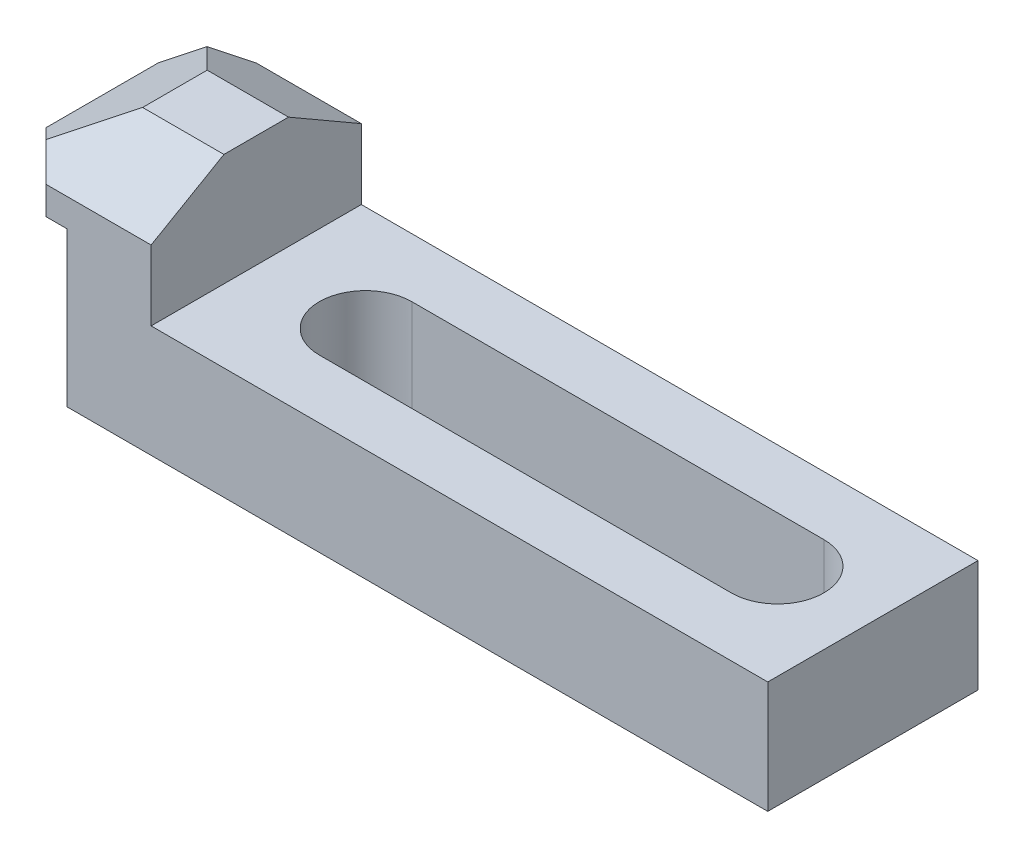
ISO-10303-21;
HEADER;
FILE_DESCRIPTION(('STEP AP214'),'2;1');
FILE_NAME('part.step','',(''),(''),'','','');
FILE_SCHEMA(('AUTOMOTIVE_DESIGN { 1 0 10303 214 1 1 1 1 }'));
ENDSEC;
DATA;
#1=APPLICATION_CONTEXT('core data for automotive mechanical design processes');
#2=APPLICATION_PROTOCOL_DEFINITION('international standard','automotive_design',2000,#1);
#3=PRODUCT_CONTEXT('',#1,'mechanical');
#4=PRODUCT('Part','Part','',(#3));
#5=PRODUCT_RELATED_PRODUCT_CATEGORY('part','',(#4));
#6=PRODUCT_DEFINITION_FORMATION('','',#4);
#7=PRODUCT_DEFINITION_CONTEXT('part definition',#1,'design');
#8=PRODUCT_DEFINITION('design','',#6,#7);
#9=PRODUCT_DEFINITION_SHAPE('','',#8);
#10=(LENGTH_UNIT() NAMED_UNIT(*) SI_UNIT(.MILLI.,.METRE.));
#11=(NAMED_UNIT(*) PLANE_ANGLE_UNIT() SI_UNIT($,.RADIAN.));
#12=(NAMED_UNIT(*) SI_UNIT($,.STERADIAN.) SOLID_ANGLE_UNIT());
#13=UNCERTAINTY_MEASURE_WITH_UNIT(LENGTH_MEASURE(1.E-05),#10,'distance_accuracy_value','');
#14=(GEOMETRIC_REPRESENTATION_CONTEXT(3) GLOBAL_UNCERTAINTY_ASSIGNED_CONTEXT((#13)) GLOBAL_UNIT_ASSIGNED_CONTEXT((#10,
#11,#12)) REPRESENTATION_CONTEXT('',''));
#15=CARTESIAN_POINT('',(0.,0.,0.));
#16=DIRECTION('',(0.,0.,1.));
#17=DIRECTION('',(1.,0.,0.));
#18=AXIS2_PLACEMENT_3D('',#15,#16,#17);
#19=CARTESIAN_POINT('',(0.,5.,7.5));
#20=DIRECTION('',(1.,0.,0.));
#21=DIRECTION('',(0.,1.,0.));
#22=AXIS2_PLACEMENT_3D('',#19,#20,#21);
#23=PLANE('',#22);
#24=DIRECTION('',(0.,0.,-1.));
#25=VECTOR('',#24,1.);
#26=CARTESIAN_POINT('',(0.,1.99999999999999,7.5));
#27=LINE('',#26,#25);
#28=CARTESIAN_POINT('',(0.,1.99999999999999,4.));
#29=VERTEX_POINT('',#28);
#30=CARTESIAN_POINT('',(0.,1.99999999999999,-4.));
#31=VERTEX_POINT('',#30);
#32=EDGE_CURVE('E171',#29,#31,#27,.T.);
#33=ORIENTED_EDGE('',*,*,#32,.T.);
#34=DIRECTION('',(0.,-1.,0.));
#35=VECTOR('',#34,1.);
#36=CARTESIAN_POINT('',(0.,5.,-4.));
#37=LINE('',#36,#35);
#38=CARTESIAN_POINT('',(0.,0.,-4.));
#39=VERTEX_POINT('',#38);
#40=EDGE_CURVE('E156',#31,#39,#37,.T.);
#41=ORIENTED_EDGE('',*,*,#40,.T.);
#42=DIRECTION('',(0.,0.,-1.));
#43=VECTOR('',#42,1.);
#44=CARTESIAN_POINT('',(0.,0.,7.5));
#45=LINE('',#44,#43);
#46=CARTESIAN_POINT('',(0.,0.,4.));
#47=VERTEX_POINT('',#46);
#48=EDGE_CURVE('E233',#47,#39,#45,.T.);
#49=ORIENTED_EDGE('',*,*,#48,.F.);
#50=DIRECTION('',(0.,-1.,0.));
#51=VECTOR('',#50,1.);
#52=CARTESIAN_POINT('',(0.,5.,4.));
#53=LINE('',#52,#51);
#54=EDGE_CURVE('E177',#29,#47,#53,.T.);
#55=ORIENTED_EDGE('',*,*,#54,.F.);
#56=EDGE_LOOP('',(#33,#41,#49,#55));
#57=FACE_BOUND('',#56,.T.);
#58=ADVANCED_FACE('F39',(#57),#23,.F.);
#59=CARTESIAN_POINT('',(0.,0.,7.5));
#60=DIRECTION('',(0.,1.,0.));
#61=DIRECTION('',(0.,0.,1.));
#62=AXIS2_PLACEMENT_3D('',#59,#60,#61);
#63=PLANE('',#62);
#64=ORIENTED_EDGE('',*,*,#48,.T.);
#65=DIRECTION('',(0.707106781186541,0.,-0.707106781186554));
#66=VECTOR('',#65,1.);
#67=CARTESIAN_POINT('',(-5.75,0.,1.75000000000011));
#68=LINE('',#67,#66);
#69=CARTESIAN_POINT('',(3.49999999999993,0.,-7.5));
#70=VERTEX_POINT('',#69);
#71=EDGE_CURVE('E159',#39,#70,#68,.T.);
#72=ORIENTED_EDGE('',*,*,#71,.T.);
#73=DIRECTION('',(1.,0.,0.));
#74=VECTOR('',#73,1.);
#75=CARTESIAN_POINT('',(0.,0.,-7.5));
#76=LINE('',#75,#74);
#77=CARTESIAN_POINT('',(5.,0.,-7.5));
#78=VERTEX_POINT('',#77);
#79=EDGE_CURVE('E197',#70,#78,#76,.T.);
#80=ORIENTED_EDGE('',*,*,#79,.T.);
#81=DIRECTION('',(0.,0.,-1.));
#82=VECTOR('',#81,1.);
#83=CARTESIAN_POINT('',(5.,0.,7.5));
#84=LINE('',#83,#82);
#85=CARTESIAN_POINT('',(5.,0.,7.5));
#86=VERTEX_POINT('',#85);
#87=EDGE_CURVE('E354',#86,#78,#84,.T.);
#88=ORIENTED_EDGE('',*,*,#87,.F.);
#89=DIRECTION('',(1.,0.,0.));
#90=VECTOR('',#89,1.);
#91=CARTESIAN_POINT('',(0.,0.,7.5));
#92=LINE('',#91,#90);
#93=CARTESIAN_POINT('',(3.49999999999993,0.,7.5));
#94=VERTEX_POINT('',#93);
#95=EDGE_CURVE('E307',#94,#86,#92,.T.);
#96=ORIENTED_EDGE('',*,*,#95,.F.);
#97=DIRECTION('',(-0.707106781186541,0.,-0.707106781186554));
#98=VECTOR('',#97,1.);
#99=CARTESIAN_POINT('',(1.75,0.,5.75000000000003));
#100=LINE('',#99,#98);
#101=EDGE_CURVE('E279',#94,#47,#100,.T.);
#102=ORIENTED_EDGE('',*,*,#101,.T.);
#103=EDGE_LOOP('',(#64,#72,#80,#88,#96,#102));
#104=FACE_BOUND('',#103,.T.);
#105=ADVANCED_FACE('F358',(#104),#63,.F.);
#106=CARTESIAN_POINT('',(5.,0.,7.5));
#107=DIRECTION('',(1.,0.,0.));
#108=DIRECTION('',(0.,1.,0.));
#109=AXIS2_PLACEMENT_3D('',#106,#107,#108);
#110=PLANE('',#109);
#111=DIRECTION('',(0.,-1.,0.));
#112=VECTOR('',#111,1.);
#113=CARTESIAN_POINT('',(5.,0.,-7.5));
#114=LINE('',#113,#112);
#115=CARTESIAN_POINT('',(5.,-11.,-7.5));
#116=VERTEX_POINT('',#115);
#117=EDGE_CURVE('E327',#78,#116,#114,.T.);
#118=ORIENTED_EDGE('',*,*,#117,.T.);
#119=DIRECTION('',(0.,0.,-1.));
#120=VECTOR('',#119,1.);
#121=CARTESIAN_POINT('',(5.,-11.,7.5));
#122=LINE('',#121,#120);
#123=CARTESIAN_POINT('',(5.,-11.,7.5));
#124=VERTEX_POINT('',#123);
#125=EDGE_CURVE('E350',#124,#116,#122,.T.);
#126=ORIENTED_EDGE('',*,*,#125,.F.);
#127=DIRECTION('',(0.,-1.,0.));
#128=VECTOR('',#127,1.);
#129=CARTESIAN_POINT('',(5.,0.,7.5));
#130=LINE('',#129,#128);
#131=EDGE_CURVE('E310',#86,#124,#130,.T.);
#132=ORIENTED_EDGE('',*,*,#131,.F.);
#133=ORIENTED_EDGE('',*,*,#87,.T.);
#134=EDGE_LOOP('',(#118,#126,#132,#133));
#135=FACE_BOUND('',#134,.T.);
#136=ADVANCED_FACE('F381',(#135),#110,.F.);
#137=CARTESIAN_POINT('',(5.,-11.,7.5));
#138=DIRECTION('',(0.,1.,0.));
#139=DIRECTION('',(0.,0.,1.));
#140=AXIS2_PLACEMENT_3D('',#137,#138,#139);
#141=PLANE('',#140);
#142=DIRECTION('',(1.,0.,0.));
#143=VECTOR('',#142,1.);
#144=CARTESIAN_POINT('',(18.8,-11.,-3.3));
#145=LINE('',#144,#143);
#146=CARTESIAN_POINT('',(18.8,-11.,-3.3));
#147=VERTEX_POINT('',#146);
#148=CARTESIAN_POINT('',(48.2,-11.,-3.3));
#149=VERTEX_POINT('',#148);
#150=EDGE_CURVE('E284',#147,#149,#145,.T.);
#151=ORIENTED_EDGE('',*,*,#150,.F.);
#152=CARTESIAN_POINT('',(18.8,-11.,0.));
#153=DIRECTION('',(0.,-1.,0.));
#154=DIRECTION('',(0.,0.,-1.));
#155=AXIS2_PLACEMENT_3D('',#152,#153,#154);
#156=CIRCLE('',#155,3.3);
#157=CARTESIAN_POINT('',(18.8,-11.,3.3));
#158=VERTEX_POINT('',#157);
#159=EDGE_CURVE('E281',#158,#147,#156,.T.);
#160=ORIENTED_EDGE('',*,*,#159,.F.);
#161=DIRECTION('',(-1.,0.,0.));
#162=VECTOR('',#161,1.);
#163=CARTESIAN_POINT('',(18.8,-11.,3.3));
#164=LINE('',#163,#162);
#165=CARTESIAN_POINT('',(48.2,-11.,3.3));
#166=VERTEX_POINT('',#165);
#167=EDGE_CURVE('E291',#166,#158,#164,.T.);
#168=ORIENTED_EDGE('',*,*,#167,.F.);
#169=CARTESIAN_POINT('',(48.2,-11.,0.));
#170=DIRECTION('',(0.,-1.,0.));
#171=DIRECTION('',(0.,0.,-1.));
#172=AXIS2_PLACEMENT_3D('',#169,#170,#171);
#173=CIRCLE('',#172,3.3);
#174=EDGE_CURVE('E288',#149,#166,#173,.T.);
#175=ORIENTED_EDGE('',*,*,#174,.F.);
#176=EDGE_LOOP('',(#151,#160,#168,#175));
#177=FACE_BOUND('',#176,.T.);
#178=DIRECTION('',(1.,0.,0.));
#179=VECTOR('',#178,1.);
#180=CARTESIAN_POINT('',(5.,-11.,-7.5));
#181=LINE('',#180,#179);
#182=CARTESIAN_POINT('',(55.,-11.,-7.5));
#183=VERTEX_POINT('',#182);
#184=EDGE_CURVE('E329',#116,#183,#181,.T.);
#185=ORIENTED_EDGE('',*,*,#184,.T.);
#186=DIRECTION('',(0.,0.,-1.));
#187=VECTOR('',#186,1.);
#188=CARTESIAN_POINT('',(55.,-11.,7.5));
#189=LINE('',#188,#187);
#190=CARTESIAN_POINT('',(55.,-11.,7.5));
#191=VERTEX_POINT('',#190);
#192=EDGE_CURVE('E346',#191,#183,#189,.T.);
#193=ORIENTED_EDGE('',*,*,#192,.F.);
#194=DIRECTION('',(1.,0.,0.));
#195=VECTOR('',#194,1.);
#196=CARTESIAN_POINT('',(5.,-11.,7.5));
#197=LINE('',#196,#195);
#198=EDGE_CURVE('E313',#124,#191,#197,.T.);
#199=ORIENTED_EDGE('',*,*,#198,.F.);
#200=ORIENTED_EDGE('',*,*,#125,.T.);
#201=EDGE_LOOP('',(#185,#193,#199,#200));
#202=FACE_BOUND('',#201,.T.);
#203=ADVANCED_FACE('F378',(#177,#202),#141,.F.);
#204=CARTESIAN_POINT('',(55.,-11.,7.5));
#205=DIRECTION('',(-1.,0.,0.));
#206=DIRECTION('',(0.,0.,1.));
#207=AXIS2_PLACEMENT_3D('',#204,#205,#206);
#208=PLANE('',#207);
#209=DIRECTION('',(0.,1.,0.));
#210=VECTOR('',#209,1.);
#211=CARTESIAN_POINT('',(55.,-11.,-7.5));
#212=LINE('',#211,#210);
#213=CARTESIAN_POINT('',(55.,-3.,-7.5));
#214=VERTEX_POINT('',#213);
#215=EDGE_CURVE('E332',#183,#214,#212,.T.);
#216=ORIENTED_EDGE('',*,*,#215,.T.);
#217=DIRECTION('',(0.,0.,-1.));
#218=VECTOR('',#217,1.);
#219=CARTESIAN_POINT('',(55.,-3.,7.5));
#220=LINE('',#219,#218);
#221=CARTESIAN_POINT('',(55.,-3.,7.5));
#222=VERTEX_POINT('',#221);
#223=EDGE_CURVE('E342',#222,#214,#220,.T.);
#224=ORIENTED_EDGE('',*,*,#223,.F.);
#225=DIRECTION('',(0.,1.,0.));
#226=VECTOR('',#225,1.);
#227=CARTESIAN_POINT('',(55.,-11.,7.5));
#228=LINE('',#227,#226);
#229=EDGE_CURVE('E316',#191,#222,#228,.T.);
#230=ORIENTED_EDGE('',*,*,#229,.F.);
#231=ORIENTED_EDGE('',*,*,#192,.T.);
#232=EDGE_LOOP('',(#216,#224,#230,#231));
#233=FACE_BOUND('',#232,.T.);
#234=ADVANCED_FACE('F374',(#233),#208,.F.);
#235=CARTESIAN_POINT('',(55.,-3.,7.5));
#236=DIRECTION('',(0.,-1.,0.));
#237=DIRECTION('',(1.,0.,0.));
#238=AXIS2_PLACEMENT_3D('',#235,#236,#237);
#239=PLANE('',#238);
#240=DIRECTION('',(-1.,0.,0.));
#241=VECTOR('',#240,1.);
#242=CARTESIAN_POINT('',(55.,-3.,3.3));
#243=LINE('',#242,#241);
#244=CARTESIAN_POINT('',(48.2,-3.,3.3));
#245=VERTEX_POINT('',#244);
#246=CARTESIAN_POINT('',(18.8,-3.00000000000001,3.3));
#247=VERTEX_POINT('',#246);
#248=EDGE_CURVE('E202',#245,#247,#243,.T.);
#249=ORIENTED_EDGE('',*,*,#248,.T.);
#250=CARTESIAN_POINT('',(18.8,-3.00000000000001,0.));
#251=DIRECTION('',(0.,-1.,0.));
#252=DIRECTION('',(1.,0.,0.));
#253=AXIS2_PLACEMENT_3D('',#250,#251,#252);
#254=CIRCLE('',#253,3.3);
#255=CARTESIAN_POINT('',(18.8,-3.00000000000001,-3.3));
#256=VERTEX_POINT('',#255);
#257=EDGE_CURVE('E206',#247,#256,#254,.T.);
#258=ORIENTED_EDGE('',*,*,#257,.T.);
#259=DIRECTION('',(1.,0.,0.));
#260=VECTOR('',#259,1.);
#261=CARTESIAN_POINT('',(55.,-3.,-3.3));
#262=LINE('',#261,#260);
#263=CARTESIAN_POINT('',(48.2,-3.,-3.3));
#264=VERTEX_POINT('',#263);
#265=EDGE_CURVE('E179',#256,#264,#262,.T.);
#266=ORIENTED_EDGE('',*,*,#265,.T.);
#267=CARTESIAN_POINT('',(48.2,-3.,0.));
#268=DIRECTION('',(0.,-1.,0.));
#269=DIRECTION('',(1.,0.,0.));
#270=AXIS2_PLACEMENT_3D('',#267,#268,#269);
#271=CIRCLE('',#270,3.3);
#272=EDGE_CURVE('E184',#264,#245,#271,.T.);
#273=ORIENTED_EDGE('',*,*,#272,.T.);
#274=EDGE_LOOP('',(#249,#258,#266,#273));
#275=FACE_BOUND('',#274,.T.);
#276=DIRECTION('',(-1.,0.,0.));
#277=VECTOR('',#276,1.);
#278=CARTESIAN_POINT('',(55.,-3.,-7.5));
#279=LINE('',#278,#277);
#280=CARTESIAN_POINT('',(11.,-3.00000000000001,-7.5));
#281=VERTEX_POINT('',#280);
#282=EDGE_CURVE('E335',#214,#281,#279,.T.);
#283=ORIENTED_EDGE('',*,*,#282,.T.);
#284=DIRECTION('',(0.,0.,-1.));
#285=VECTOR('',#284,1.);
#286=CARTESIAN_POINT('',(11.,-3.00000000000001,7.5));
#287=LINE('',#286,#285);
#288=CARTESIAN_POINT('',(11.,-3.00000000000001,7.5));
#289=VERTEX_POINT('',#288);
#290=EDGE_CURVE('E256',#289,#281,#287,.T.);
#291=ORIENTED_EDGE('',*,*,#290,.F.);
#292=DIRECTION('',(-1.,0.,0.));
#293=VECTOR('',#292,1.);
#294=CARTESIAN_POINT('',(55.,-3.,7.5));
#295=LINE('',#294,#293);
#296=EDGE_CURVE('E319',#222,#289,#295,.T.);
#297=ORIENTED_EDGE('',*,*,#296,.F.);
#298=ORIENTED_EDGE('',*,*,#223,.T.);
#299=EDGE_LOOP('',(#283,#291,#297,#298));
#300=FACE_BOUND('',#299,.T.);
#301=ADVANCED_FACE('F370',(#275,#300),#239,.F.);
#302=CARTESIAN_POINT('',(11.,-3.00000000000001,7.5));
#303=DIRECTION('',(-1.,0.,0.));
#304=DIRECTION('',(0.,-1.,0.));
#305=AXIS2_PLACEMENT_3D('',#302,#303,#304);
#306=PLANE('',#305);
#307=DIRECTION('',(0.,1.,0.));
#308=VECTOR('',#307,1.);
#309=CARTESIAN_POINT('',(11.,-3.00000000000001,-7.5));
#310=LINE('',#309,#308);
#311=CARTESIAN_POINT('',(11.,1.99999999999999,-7.5));
#312=VERTEX_POINT('',#311);
#313=EDGE_CURVE('E250',#281,#312,#310,.T.);
#314=ORIENTED_EDGE('',*,*,#313,.T.);
#315=DIRECTION('',(0.,-0.500000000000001,-0.866025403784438));
#316=VECTOR('',#315,1.);
#317=CARTESIAN_POINT('',(11.,5.,-2.30384757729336));
#318=LINE('',#317,#316);
#319=CARTESIAN_POINT('',(11.,5.,-2.30384757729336));
#320=VERTEX_POINT('',#319);
#321=EDGE_CURVE('E188',#312,#320,#318,.F.);
#322=ORIENTED_EDGE('',*,*,#321,.T.);
#323=DIRECTION('',(0.,0.,-1.));
#324=VECTOR('',#323,1.);
#325=CARTESIAN_POINT('',(11.,5.,7.5));
#326=LINE('',#325,#324);
#327=CARTESIAN_POINT('',(11.,5.,2.30384757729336));
#328=VERTEX_POINT('',#327);
#329=EDGE_CURVE('E247',#328,#320,#326,.T.);
#330=ORIENTED_EDGE('',*,*,#329,.F.);
#331=DIRECTION('',(0.,-0.500000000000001,0.866025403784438));
#332=VECTOR('',#331,1.);
#333=CARTESIAN_POINT('',(11.,1.99999999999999,7.5));
#334=LINE('',#333,#332);
#335=CARTESIAN_POINT('',(11.,1.99999999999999,7.5));
#336=VERTEX_POINT('',#335);
#337=EDGE_CURVE('E220',#328,#336,#334,.T.);
#338=ORIENTED_EDGE('',*,*,#337,.T.);
#339=DIRECTION('',(0.,1.,0.));
#340=VECTOR('',#339,1.);
#341=CARTESIAN_POINT('',(11.,-3.00000000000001,7.5));
#342=LINE('',#341,#340);
#343=EDGE_CURVE('E257',#289,#336,#342,.T.);
#344=ORIENTED_EDGE('',*,*,#343,.F.);
#345=ORIENTED_EDGE('',*,*,#290,.T.);
#346=EDGE_LOOP('',(#314,#322,#330,#338,#344,#345));
#347=FACE_BOUND('',#346,.T.);
#348=ADVANCED_FACE('F246',(#347),#306,.F.);
#349=CARTESIAN_POINT('',(11.,5.,7.5));
#350=DIRECTION('',(0.,-1.,0.));
#351=DIRECTION('',(1.,0.,0.));
#352=AXIS2_PLACEMENT_3D('',#349,#350,#351);
#353=PLANE('',#352);
#354=ORIENTED_EDGE('',*,*,#329,.T.);
#355=DIRECTION('',(-1.,0.,0.));
#356=VECTOR('',#355,1.);
#357=CARTESIAN_POINT('',(11.,5.,-2.30384757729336));
#358=LINE('',#357,#356);
#359=CARTESIAN_POINT('',(5.19615242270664,5.,-2.30384757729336));
#360=VERTEX_POINT('',#359);
#361=EDGE_CURVE('E225',#320,#360,#358,.T.);
#362=ORIENTED_EDGE('',*,*,#361,.T.);
#363=DIRECTION('',(0.,0.,1.));
#364=VECTOR('',#363,1.);
#365=CARTESIAN_POINT('',(5.19615242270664,5.,7.5));
#366=LINE('',#365,#364);
#367=CARTESIAN_POINT('',(5.19615242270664,5.,2.30384757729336));
#368=VERTEX_POINT('',#367);
#369=EDGE_CURVE('E226',#360,#368,#366,.T.);
#370=ORIENTED_EDGE('',*,*,#369,.T.);
#371=DIRECTION('',(1.,0.,0.));
#372=VECTOR('',#371,1.);
#373=CARTESIAN_POINT('',(11.,5.,2.30384757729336));
#374=LINE('',#373,#372);
#375=EDGE_CURVE('E219',#368,#328,#374,.T.);
#376=ORIENTED_EDGE('',*,*,#375,.T.);
#377=EDGE_LOOP('',(#354,#362,#370,#376));
#378=FACE_BOUND('',#377,.T.);
#379=ADVANCED_FACE('F254',(#378),#353,.F.);
#380=CARTESIAN_POINT('',(0.,0.,7.5));
#381=DIRECTION('',(0.,0.,1.));
#382=DIRECTION('',(1.,0.,0.));
#383=AXIS2_PLACEMENT_3D('',#380,#381,#382);
#384=PLANE('',#383);
#385=DIRECTION('',(0.,-1.,0.));
#386=VECTOR('',#385,1.);
#387=CARTESIAN_POINT('',(3.49999999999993,5.,7.5));
#388=LINE('',#387,#386);
#389=CARTESIAN_POINT('',(3.49999999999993,1.99999999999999,7.5));
#390=VERTEX_POINT('',#389);
#391=EDGE_CURVE('E271',#390,#94,#388,.T.);
#392=ORIENTED_EDGE('',*,*,#391,.T.);
#393=ORIENTED_EDGE('',*,*,#95,.T.);
#394=ORIENTED_EDGE('',*,*,#131,.T.);
#395=ORIENTED_EDGE('',*,*,#198,.T.);
#396=ORIENTED_EDGE('',*,*,#229,.T.);
#397=ORIENTED_EDGE('',*,*,#296,.T.);
#398=ORIENTED_EDGE('',*,*,#343,.T.);
#399=DIRECTION('',(-1.,0.,0.));
#400=VECTOR('',#399,1.);
#401=CARTESIAN_POINT('',(0.,1.99999999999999,7.5));
#402=LINE('',#401,#400);
#403=EDGE_CURVE('E180',#336,#390,#402,.T.);
#404=ORIENTED_EDGE('',*,*,#403,.T.);
#405=EDGE_LOOP('',(#392,#393,#394,#395,#396,#397,#398,#404));
#406=FACE_BOUND('',#405,.T.);
#407=ADVANCED_FACE('F362',(#406),#384,.T.);
#408=CARTESIAN_POINT('',(0.,0.,-7.5));
#409=DIRECTION('',(0.,0.,1.));
#410=DIRECTION('',(1.,0.,0.));
#411=AXIS2_PLACEMENT_3D('',#408,#409,#410);
#412=PLANE('',#411);
#413=ORIENTED_EDGE('',*,*,#79,.F.);
#414=DIRECTION('',(0.,-1.,0.));
#415=VECTOR('',#414,1.);
#416=CARTESIAN_POINT('',(3.49999999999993,5.,-7.5));
#417=LINE('',#416,#415);
#418=CARTESIAN_POINT('',(3.49999999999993,1.99999999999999,-7.5));
#419=VERTEX_POINT('',#418);
#420=EDGE_CURVE('E165',#419,#70,#417,.T.);
#421=ORIENTED_EDGE('',*,*,#420,.F.);
#422=DIRECTION('',(1.,0.,0.));
#423=VECTOR('',#422,1.);
#424=CARTESIAN_POINT('',(0.,1.99999999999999,-7.5));
#425=LINE('',#424,#423);
#426=EDGE_CURVE('E230',#419,#312,#425,.T.);
#427=ORIENTED_EDGE('',*,*,#426,.T.);
#428=ORIENTED_EDGE('',*,*,#313,.F.);
#429=ORIENTED_EDGE('',*,*,#282,.F.);
#430=ORIENTED_EDGE('',*,*,#215,.F.);
#431=ORIENTED_EDGE('',*,*,#184,.F.);
#432=ORIENTED_EDGE('',*,*,#117,.F.);
#433=EDGE_LOOP('',(#413,#421,#427,#428,#429,#430,#431,#432));
#434=FACE_BOUND('',#433,.T.);
#435=ADVANCED_FACE('F263',(#434),#412,.F.);
#436=CARTESIAN_POINT('',(0.,1.99999999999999,7.5));
#437=DIRECTION('',(0.,0.866025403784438,0.500000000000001));
#438=DIRECTION('',(0.,-0.500000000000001,0.866025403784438));
#439=AXIS2_PLACEMENT_3D('',#436,#437,#438);
#440=PLANE('',#439);
#441=DIRECTION('',(-0.65465367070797,0.377964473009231,-0.654653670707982));
#442=VECTOR('',#441,1.);
#443=CARTESIAN_POINT('',(2.,2.86602540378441,6.00000000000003));
#444=LINE('',#443,#442);
#445=CARTESIAN_POINT('',(1.74999999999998,3.01036297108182,5.75000000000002));
#446=VERTEX_POINT('',#445);
#447=EDGE_CURVE('E62',#390,#446,#444,.T.);
#448=ORIENTED_EDGE('',*,*,#447,.F.);
#449=ORIENTED_EDGE('',*,*,#403,.F.);
#450=ORIENTED_EDGE('',*,*,#337,.F.);
#451=ORIENTED_EDGE('',*,*,#375,.F.);
#452=DIRECTION('',(-0.654653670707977,-0.377964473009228,0.654653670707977));
#453=VECTOR('',#452,1.);
#454=CARTESIAN_POINT('',(0.,1.99999999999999,7.5));
#455=LINE('',#454,#453);
#456=EDGE_CURVE('E194',#446,#368,#455,.F.);
#457=ORIENTED_EDGE('',*,*,#456,.F.);
#458=EDGE_LOOP('',(#448,#449,#450,#451,#457));
#459=FACE_BOUND('',#458,.T.);
#460=ADVANCED_FACE('F41',(#459),#440,.T.);
#461=CARTESIAN_POINT('',(0.,1.99999999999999,7.5));
#462=DIRECTION('',(0.500000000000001,-0.866025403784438,0.));
#463=DIRECTION('',(0.866025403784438,0.500000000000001,0.));
#464=AXIS2_PLACEMENT_3D('',#461,#462,#463);
#465=PLANE('',#464);
#466=DIRECTION('',(-0.654653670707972,-0.377964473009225,0.654653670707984));
#467=VECTOR('',#466,1.);
#468=CARTESIAN_POINT('',(-4.92857142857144,-0.845512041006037,0.928571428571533));
#469=LINE('',#468,#467);
#470=CARTESIAN_POINT('',(1.74999999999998,3.01036297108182,-5.75000000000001));
#471=VERTEX_POINT('',#470);
#472=EDGE_CURVE('E54',#31,#471,#469,.F.);
#473=ORIENTED_EDGE('',*,*,#472,.F.);
#474=ORIENTED_EDGE('',*,*,#32,.F.);
#475=DIRECTION('',(0.654653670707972,0.377964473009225,0.654653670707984));
#476=VECTOR('',#475,1.);
#477=CARTESIAN_POINT('',(1.5,2.86602540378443,5.50000000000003));
#478=LINE('',#477,#476);
#479=EDGE_CURVE('E48',#446,#29,#478,.F.);
#480=ORIENTED_EDGE('',*,*,#479,.F.);
#481=ORIENTED_EDGE('',*,*,#456,.T.);
#482=ORIENTED_EDGE('',*,*,#369,.F.);
#483=DIRECTION('',(-0.654653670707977,-0.377964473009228,-0.654653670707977));
#484=VECTOR('',#483,1.);
#485=CARTESIAN_POINT('',(6.42857142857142,5.71153744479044,-1.07142857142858));
#486=LINE('',#485,#484);
#487=EDGE_CURVE('E173',#471,#360,#486,.F.);
#488=ORIENTED_EDGE('',*,*,#487,.F.);
#489=EDGE_LOOP('',(#473,#474,#480,#481,#482,#488));
#490=FACE_BOUND('',#489,.T.);
#491=ADVANCED_FACE('F170',(#490),#465,.F.);
#492=CARTESIAN_POINT('',(11.,5.,-2.30384757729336));
#493=DIRECTION('',(0.,-0.866025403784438,0.500000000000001));
#494=DIRECTION('',(0.,-0.500000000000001,-0.866025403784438));
#495=AXIS2_PLACEMENT_3D('',#492,#493,#494);
#496=PLANE('',#495);
#497=DIRECTION('',(-0.65465367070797,0.377964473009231,0.654653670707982));
#498=VECTOR('',#497,1.);
#499=CARTESIAN_POINT('',(3.74505575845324,1.8585169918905,-7.74505575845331));
#500=LINE('',#499,#498);
#501=EDGE_CURVE('E11',#471,#419,#500,.F.);
#502=ORIENTED_EDGE('',*,*,#501,.F.);
#503=ORIENTED_EDGE('',*,*,#487,.T.);
#504=ORIENTED_EDGE('',*,*,#361,.F.);
#505=ORIENTED_EDGE('',*,*,#321,.F.);
#506=ORIENTED_EDGE('',*,*,#426,.F.);
#507=EDGE_LOOP('',(#502,#503,#504,#505,#506));
#508=FACE_BOUND('',#507,.T.);
#509=ADVANCED_FACE('F259',(#508),#496,.F.);
#510=CARTESIAN_POINT('',(18.8,5.,0.));
#511=DIRECTION('',(0.,-1.,0.));
#512=DIRECTION('',(0.,0.,-1.));
#513=AXIS2_PLACEMENT_3D('',#510,#511,#512);
#514=CYLINDRICAL_SURFACE('',#513,3.3);
#515=DIRECTION('',(0.,-1.,0.));
#516=VECTOR('',#515,1.);
#517=CARTESIAN_POINT('',(18.8,5.,3.3));
#518=LINE('',#517,#516);
#519=EDGE_CURVE('E195',#247,#158,#518,.T.);
#520=ORIENTED_EDGE('',*,*,#519,.T.);
#521=ORIENTED_EDGE('',*,*,#159,.T.);
#522=DIRECTION('',(0.,-1.,0.));
#523=VECTOR('',#522,1.);
#524=CARTESIAN_POINT('',(18.8,5.,-3.3));
#525=LINE('',#524,#523);
#526=EDGE_CURVE('E295',#256,#147,#525,.T.);
#527=ORIENTED_EDGE('',*,*,#526,.F.);
#528=ORIENTED_EDGE('',*,*,#257,.F.);
#529=EDGE_LOOP('',(#520,#521,#527,#528));
#530=FACE_BOUND('',#529,.T.);
#531=ADVANCED_FACE('F398',(#530),#514,.F.);
#532=CARTESIAN_POINT('',(18.8,5.,3.3));
#533=DIRECTION('',(0.,0.,1.));
#534=DIRECTION('',(1.,0.,0.));
#535=AXIS2_PLACEMENT_3D('',#532,#533,#534);
#536=PLANE('',#535);
#537=DIRECTION('',(0.,-1.,0.));
#538=VECTOR('',#537,1.);
#539=CARTESIAN_POINT('',(48.2,5.,3.3));
#540=LINE('',#539,#538);
#541=EDGE_CURVE('E298',#245,#166,#540,.T.);
#542=ORIENTED_EDGE('',*,*,#541,.T.);
#543=ORIENTED_EDGE('',*,*,#167,.T.);
#544=ORIENTED_EDGE('',*,*,#519,.F.);
#545=ORIENTED_EDGE('',*,*,#248,.F.);
#546=EDGE_LOOP('',(#542,#543,#544,#545));
#547=FACE_BOUND('',#546,.T.);
#548=ADVANCED_FACE('F458',(#547),#536,.F.);
#549=CARTESIAN_POINT('',(48.2,5.,0.));
#550=DIRECTION('',(0.,-1.,0.));
#551=DIRECTION('',(0.,0.,-1.));
#552=AXIS2_PLACEMENT_3D('',#549,#550,#551);
#553=CYLINDRICAL_SURFACE('',#552,3.3);
#554=DIRECTION('',(0.,-1.,0.));
#555=VECTOR('',#554,1.);
#556=CARTESIAN_POINT('',(48.2,5.,-3.3));
#557=LINE('',#556,#555);
#558=EDGE_CURVE('E301',#264,#149,#557,.T.);
#559=ORIENTED_EDGE('',*,*,#558,.T.);
#560=ORIENTED_EDGE('',*,*,#174,.T.);
#561=ORIENTED_EDGE('',*,*,#541,.F.);
#562=ORIENTED_EDGE('',*,*,#272,.F.);
#563=EDGE_LOOP('',(#559,#560,#561,#562));
#564=FACE_BOUND('',#563,.T.);
#565=ADVANCED_FACE('F466',(#564),#553,.F.);
#566=CARTESIAN_POINT('',(18.8,5.,-3.3));
#567=DIRECTION('',(0.,0.,-1.));
#568=DIRECTION('',(-1.,0.,0.));
#569=AXIS2_PLACEMENT_3D('',#566,#567,#568);
#570=PLANE('',#569);
#571=ORIENTED_EDGE('',*,*,#526,.T.);
#572=ORIENTED_EDGE('',*,*,#150,.T.);
#573=ORIENTED_EDGE('',*,*,#558,.F.);
#574=ORIENTED_EDGE('',*,*,#265,.F.);
#575=EDGE_LOOP('',(#571,#572,#573,#574));
#576=FACE_BOUND('',#575,.T.);
#577=ADVANCED_FACE('F475',(#576),#570,.F.);
#578=CARTESIAN_POINT('',(3.49999999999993,5.,7.5));
#579=DIRECTION('',(0.707106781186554,0.,-0.707106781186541));
#580=DIRECTION('',(-0.707106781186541,0.,-0.707106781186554));
#581=AXIS2_PLACEMENT_3D('',#578,#579,#580);
#582=PLANE('',#581);
#583=ORIENTED_EDGE('',*,*,#391,.F.);
#584=ORIENTED_EDGE('',*,*,#447,.T.);
#585=ORIENTED_EDGE('',*,*,#479,.T.);
#586=ORIENTED_EDGE('',*,*,#54,.T.);
#587=ORIENTED_EDGE('',*,*,#101,.F.);
#588=EDGE_LOOP('',(#583,#584,#585,#586,#587));
#589=FACE_BOUND('',#588,.T.);
#590=ADVANCED_FACE('F211',(#589),#582,.F.);
#591=CARTESIAN_POINT('',(3.49999999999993,5.,-7.5));
#592=DIRECTION('',(0.707106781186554,0.,0.707106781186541));
#593=DIRECTION('',(0.707106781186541,0.,-0.707106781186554));
#594=AXIS2_PLACEMENT_3D('',#591,#592,#593);
#595=PLANE('',#594);
#596=ORIENTED_EDGE('',*,*,#40,.F.);
#597=ORIENTED_EDGE('',*,*,#472,.T.);
#598=ORIENTED_EDGE('',*,*,#501,.T.);
#599=ORIENTED_EDGE('',*,*,#420,.T.);
#600=ORIENTED_EDGE('',*,*,#71,.F.);
#601=EDGE_LOOP('',(#596,#597,#598,#599,#600));
#602=FACE_BOUND('',#601,.T.);
#603=ADVANCED_FACE('F157',(#602),#595,.F.);
#604=CLOSED_SHELL('',(#58,#105,#136,#203,#234,#301,#348,#379,#407,#435,#460,#491,#509,#531,#548,
#565,#577,#590,#603));
#605=MANIFOLD_SOLID_BREP('B2',#604);
#606=ADVANCED_BREP_SHAPE_REPRESENTATION('',(#18,#605),#14);
#607=SHAPE_DEFINITION_REPRESENTATION(#9,#606);
ENDSEC;
END-ISO-10303-21;
